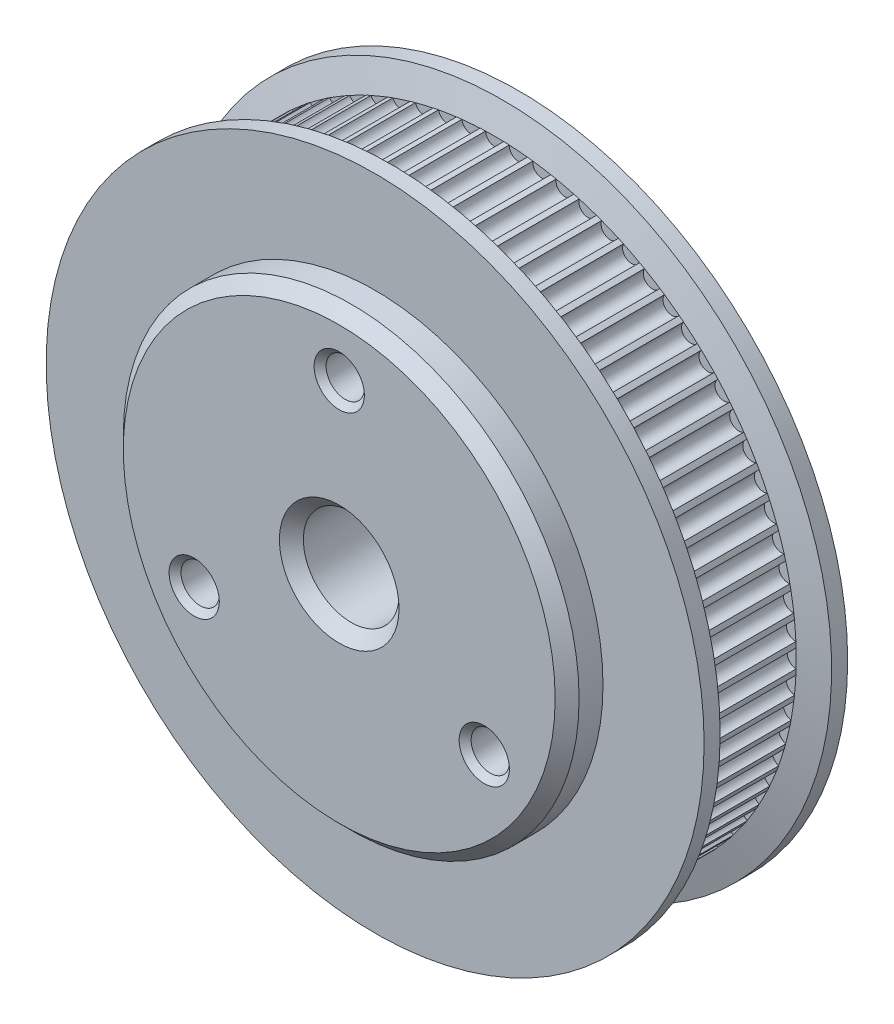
from build123d import *

# Parameters (mm, degrees)
BOSS_EXTRU_1_DEPTH           = 6
BOSS_EXTRU_1_DEPTH_BACK      = 6
ESQUISSE3_R                  = 27.5
BOSS_EXTRU_2_DEPTH           = 2
ESQUISSE7_R                  = 19.05
BOSS_EXTRU_3_DEPTH           = 3
ENL_V_MAT_EXTRU_1_DEPTH      = 40.918667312
ENL_V_MAT_EXTRU_1_DEPTH_BACK = 40.918667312
ESQUISSE6_R                  = 4
ESQUISSE6_R_2                = 1.6
CHANFREIN4_SIZE              = 1
CHANFREIN5_SIZE              = 0.5


with BuildPart() as part:
    # Esquisse1 → Boss.-Extru.1 (new, two sides: drawn at the far end of the back side and taken through both)
    with BuildSketch(Plane.XY.offset(-BOSS_EXTRU_1_DEPTH_BACK)):
        with BuildLine():
            ThreePointArc((0.759913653, -25.198044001), (0.989720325, -25.190064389), (1.219444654, -25.179988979))
            ThreePointArc((1.219444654, -25.179988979), (1.918285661, -24.374130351), (2.734586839, -25.060744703))
            ThreePointArc((2.734586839, -25.060744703), (2.963059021, -25.034759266), (3.191284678, -25.006690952))
            ThreePointArc((3.191284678, -25.006690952), (3.824744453, -24.148486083), (4.692400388, -24.76893758))
            ThreePointArc((4.692400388, -24.76893758), (4.918129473, -24.725106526), (5.143449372, -24.679218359))
            ThreePointArc((5.143449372, -24.679218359), (5.707622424, -23.773958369), (6.621283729, -24.32442172))
            ThreePointArc((6.621283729, -24.32442172), (6.842878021, -24.263015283), (7.06390299, -24.199590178))
            ThreePointArc((7.06390299, -24.199590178), (7.555311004, -23.252856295), (8.509344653, -23.729937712))
            ThreePointArc((8.509344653, -23.729937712), (8.72543795, -23.651334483), (8.940805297, -23.570763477))
            ThreePointArc((8.940805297, -23.570763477), (9.35641858, -22.58839263), (10.344942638, -22.989150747))
            ThreePointArc((10.344942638, -22.989150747), (10.554202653, -22.893835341), (10.762584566, -22.796615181))
            ThreePointArc((10.762584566, -22.796615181), (11.099840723, -21.784664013), (12.116760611, -22.106628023))
            ThreePointArc((12.116760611, -22.106628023), (12.317897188, -21.99518809), (12.518008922, -21.881918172))
            ThreePointArc((12.518008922, -21.881918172), (12.774828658, -20.846625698), (13.813874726, -21.087810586))
            ThreePointArc((13.813874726, -21.087810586), (14.005647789, -20.960933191), (14.196255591, -20.83231186))
            ThreePointArc((14.196255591, -20.83231186), (14.371055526, -19.780061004), (15.42582171, -19.938979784))
            ThreePointArc((15.42582171, -19.938979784), (15.607048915, -19.797447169), (15.786977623, -19.654267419))
            ThreePointArc((15.786977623, -19.654267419), (15.878680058, -18.591545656), (16.942663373, -18.667218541))
            ThreePointArc((16.942663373, -18.667218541), (17.112227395, -18.511903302), (17.280367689, -18.355047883))
            ThreePointArc((17.280367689, -18.355047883), (17.288407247, -17.288407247), (18.355047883, -17.280367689))
            ThreePointArc((18.355047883, -17.280367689), (18.511903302, -17.112227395), (18.667218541, -16.942663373))
            ThreePointArc((18.667218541, -16.942663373), (18.591545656, -15.878680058), (19.654267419, -15.786977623))
            ThreePointArc((19.654267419, -15.786977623), (19.797447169, -15.607048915), (19.938979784, -15.42582171))
            ThreePointArc((19.938979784, -15.42582171), (19.780061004, -14.371055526), (20.83231186, -14.196255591))
            ThreePointArc((20.83231186, -14.196255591), (20.960933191, -14.005647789), (21.087810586, -13.813874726))
            ThreePointArc((21.087810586, -13.813874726), (20.846625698, -12.774828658), (21.881918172, -12.518008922))
            ThreePointArc((21.881918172, -12.518008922), (21.99518809, -12.317897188), (22.106628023, -12.116760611))
            ThreePointArc((22.106628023, -12.116760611), (21.784664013, -11.099840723), (22.796615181, -10.762584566))
            ThreePointArc((22.796615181, -10.762584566), (22.893835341, -10.554202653), (22.989150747, -10.344942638))
            ThreePointArc((22.989150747, -10.344942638), (22.58839263, -9.35641858), (23.570763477, -8.940805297))
            ThreePointArc((23.570763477, -8.940805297), (23.651334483, -8.72543795), (23.729937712, -8.509344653))
            ThreePointArc((23.729937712, -8.509344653), (23.252856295, -7.555311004), (24.199590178, -7.06390299))
            ThreePointArc((24.199590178, -7.06390299), (24.263015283, -6.842878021), (24.32442172, -6.621283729))
            ThreePointArc((24.32442172, -6.621283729), (23.773958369, -5.707622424), (24.679218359, -5.143449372))
            ThreePointArc((24.679218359, -5.143449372), (24.725106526, -4.918129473), (24.76893758, -4.692400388))
            ThreePointArc((24.76893758, -4.692400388), (24.148486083, -3.824744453), (25.006690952, -3.191284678))
            ThreePointArc((25.006690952, -3.191284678), (25.034759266, -2.963059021), (25.060744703, -2.734586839))
            ThreePointArc((25.060744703, -2.734586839), (24.374130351, -1.918285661), (25.179988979, -1.219444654))
            ThreePointArc((25.179988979, -1.219444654), (25.190064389, -0.989720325), (25.198044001, -0.759913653))
            ThreePointArc((25.198044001, -0.759913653), (24.4495, 0), (25.198044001, 0.759913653))
            ThreePointArc((25.198044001, 0.759913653), (25.190064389, 0.989720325), (25.179988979, 1.219444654))
            ThreePointArc((25.179988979, 1.219444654), (24.374130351, 1.918285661), (25.060744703, 2.734586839))
            ThreePointArc((25.060744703, 2.734586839), (25.034759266, 2.963059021), (25.006690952, 3.191284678))
            ThreePointArc((25.006690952, 3.191284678), (24.148486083, 3.824744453), (24.76893758, 4.692400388))
            ThreePointArc((24.76893758, 4.692400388), (24.725106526, 4.918129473), (24.679218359, 5.143449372))
            ThreePointArc((24.679218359, 5.143449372), (23.773958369, 5.707622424), (24.32442172, 6.621283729))
            ThreePointArc((24.32442172, 6.621283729), (24.263015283, 6.842878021), (24.199590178, 7.06390299))
            ThreePointArc((24.199590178, 7.06390299), (23.252856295, 7.555311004), (23.729937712, 8.509344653))
            ThreePointArc((23.729937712, 8.509344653), (23.651334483, 8.72543795), (23.570763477, 8.940805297))
            ThreePointArc((23.570763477, 8.940805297), (22.58839263, 9.35641858), (22.989150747, 10.344942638))
            ThreePointArc((22.989150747, 10.344942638), (22.893835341, 10.554202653), (22.796615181, 10.762584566))
            ThreePointArc((22.796615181, 10.762584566), (21.784664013, 11.099840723), (22.106628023, 12.116760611))
            ThreePointArc((22.106628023, 12.116760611), (21.99518809, 12.317897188), (21.881918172, 12.518008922))
            ThreePointArc((21.881918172, 12.518008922), (20.846625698, 12.774828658), (21.087810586, 13.813874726))
            ThreePointArc((21.087810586, 13.813874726), (20.960933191, 14.005647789), (20.83231186, 14.196255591))
            ThreePointArc((20.83231186, 14.196255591), (19.780061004, 14.371055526), (19.938979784, 15.42582171))
            ThreePointArc((19.938979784, 15.42582171), (19.797447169, 15.607048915), (19.654267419, 15.786977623))
            ThreePointArc((19.654267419, 15.786977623), (18.591545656, 15.878680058), (18.667218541, 16.942663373))
            ThreePointArc((18.667218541, 16.942663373), (18.511903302, 17.112227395), (18.355047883, 17.280367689))
            ThreePointArc((18.355047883, 17.280367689), (17.288407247, 17.288407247), (17.280367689, 18.355047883))
            ThreePointArc((17.280367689, 18.355047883), (17.112227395, 18.511903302), (16.942663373, 18.667218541))
            ThreePointArc((16.942663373, 18.667218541), (15.878680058, 18.591545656), (15.786977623, 19.654267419))
            ThreePointArc((15.786977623, 19.654267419), (15.607048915, 19.797447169), (15.42582171, 19.938979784))
            ThreePointArc((15.42582171, 19.938979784), (14.371055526, 19.780061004), (14.196255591, 20.83231186))
            ThreePointArc((14.196255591, 20.83231186), (14.005647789, 20.960933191), (13.813874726, 21.087810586))
            ThreePointArc((13.813874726, 21.087810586), (12.774828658, 20.846625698), (12.518008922, 21.881918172))
            ThreePointArc((12.518008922, 21.881918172), (12.317897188, 21.99518809), (12.116760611, 22.106628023))
            ThreePointArc((12.116760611, 22.106628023), (11.099840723, 21.784664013), (10.762584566, 22.796615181))
            ThreePointArc((10.762584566, 22.796615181), (10.554202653, 22.893835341), (10.344942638, 22.989150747))
            ThreePointArc((10.344942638, 22.989150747), (9.35641858, 22.58839263), (8.940805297, 23.570763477))
            ThreePointArc((8.940805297, 23.570763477), (8.72543795, 23.651334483), (8.509344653, 23.729937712))
            ThreePointArc((8.509344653, 23.729937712), (7.555311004, 23.252856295), (7.06390299, 24.199590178))
            ThreePointArc((7.06390299, 24.199590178), (6.842878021, 24.263015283), (6.621283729, 24.32442172))
            ThreePointArc((6.621283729, 24.32442172), (5.707622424, 23.773958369), (5.143449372, 24.679218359))
            ThreePointArc((5.143449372, 24.679218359), (4.918129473, 24.725106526), (4.692400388, 24.76893758))
            ThreePointArc((4.692400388, 24.76893758), (3.824744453, 24.148486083), (3.191284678, 25.006690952))
            ThreePointArc((3.191284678, 25.006690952), (2.963059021, 25.034759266), (2.734586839, 25.060744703))
            ThreePointArc((2.734586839, 25.060744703), (1.918285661, 24.374130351), (1.219444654, 25.179988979))
            ThreePointArc((1.219444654, 25.179988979), (0.989720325, 25.190064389), (0.759913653, 25.198044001))
            ThreePointArc((0.759913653, 25.198044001), (0, 24.4495), (-0.759913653, 25.198044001))
            ThreePointArc((-0.759913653, 25.198044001), (-0.989720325, 25.190064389), (-1.219444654, 25.179988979))
            ThreePointArc((-1.219444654, 25.179988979), (-1.918285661, 24.374130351), (-2.734586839, 25.060744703))
            ThreePointArc((-2.734586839, 25.060744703), (-2.963059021, 25.034759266), (-3.191284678, 25.006690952))
            ThreePointArc((-3.191284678, 25.006690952), (-3.824744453, 24.148486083), (-4.692400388, 24.76893758))
            ThreePointArc((-4.692400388, 24.76893758), (-4.918129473, 24.725106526), (-5.143449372, 24.679218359))
            ThreePointArc((-5.143449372, 24.679218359), (-5.707622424, 23.773958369), (-6.621283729, 24.32442172))
            ThreePointArc((-6.621283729, 24.32442172), (-6.842878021, 24.263015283), (-7.06390299, 24.199590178))
            ThreePointArc((-7.06390299, 24.199590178), (-7.555311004, 23.252856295), (-8.509344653, 23.729937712))
            ThreePointArc((-8.509344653, 23.729937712), (-8.72543795, 23.651334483), (-8.940805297, 23.570763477))
            ThreePointArc((-8.940805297, 23.570763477), (-9.35641858, 22.58839263), (-10.344942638, 22.989150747))
            ThreePointArc((-10.344942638, 22.989150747), (-10.554202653, 22.893835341), (-10.762584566, 22.796615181))
            ThreePointArc((-10.762584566, 22.796615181), (-11.099840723, 21.784664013), (-12.116760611, 22.106628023))
            ThreePointArc((-12.116760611, 22.106628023), (-12.317897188, 21.99518809), (-12.518008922, 21.881918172))
            ThreePointArc((-12.518008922, 21.881918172), (-12.774828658, 20.846625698), (-13.813874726, 21.087810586))
            ThreePointArc((-13.813874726, 21.087810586), (-14.005647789, 20.960933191), (-14.196255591, 20.83231186))
            ThreePointArc((-14.196255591, 20.83231186), (-14.371055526, 19.780061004), (-15.42582171, 19.938979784))
            ThreePointArc((-15.42582171, 19.938979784), (-15.607048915, 19.797447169), (-15.786977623, 19.654267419))
            ThreePointArc((-15.786977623, 19.654267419), (-15.878680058, 18.591545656), (-16.942663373, 18.667218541))
            ThreePointArc((-16.942663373, 18.667218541), (-17.112227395, 18.511903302), (-17.280367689, 18.355047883))
            ThreePointArc((-17.280367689, 18.355047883), (-17.288407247, 17.288407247), (-18.355047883, 17.280367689))
            ThreePointArc((-18.355047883, 17.280367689), (-18.511903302, 17.112227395), (-18.667218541, 16.942663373))
            ThreePointArc((-18.667218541, 16.942663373), (-18.591545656, 15.878680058), (-19.654267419, 15.786977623))
            ThreePointArc((-19.654267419, 15.786977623), (-19.797447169, 15.607048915), (-19.938979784, 15.42582171))
            ThreePointArc((-19.938979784, 15.42582171), (-19.780061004, 14.371055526), (-20.83231186, 14.196255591))
            ThreePointArc((-20.83231186, 14.196255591), (-20.960933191, 14.005647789), (-21.087810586, 13.813874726))
            ThreePointArc((-21.087810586, 13.813874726), (-20.846625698, 12.774828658), (-21.881918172, 12.518008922))
            ThreePointArc((-21.881918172, 12.518008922), (-21.99518809, 12.317897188), (-22.106628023, 12.116760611))
            ThreePointArc((-22.106628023, 12.116760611), (-21.784664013, 11.099840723), (-22.796615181, 10.762584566))
            ThreePointArc((-22.796615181, 10.762584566), (-22.893835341, 10.554202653), (-22.989150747, 10.344942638))
            ThreePointArc((-22.989150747, 10.344942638), (-22.58839263, 9.35641858), (-23.570763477, 8.940805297))
            ThreePointArc((-23.570763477, 8.940805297), (-23.651334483, 8.72543795), (-23.729937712, 8.509344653))
            ThreePointArc((-23.729937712, 8.509344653), (-23.252856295, 7.555311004), (-24.199590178, 7.06390299))
            ThreePointArc((-24.199590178, 7.06390299), (-24.263015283, 6.842878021), (-24.32442172, 6.621283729))
            ThreePointArc((-24.32442172, 6.621283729), (-23.773958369, 5.707622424), (-24.679218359, 5.143449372))
            ThreePointArc((-24.679218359, 5.143449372), (-24.725106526, 4.918129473), (-24.76893758, 4.692400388))
            ThreePointArc((-24.76893758, 4.692400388), (-24.148486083, 3.824744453), (-25.006690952, 3.191284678))
            ThreePointArc((-25.006690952, 3.191284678), (-25.034759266, 2.963059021), (-25.060744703, 2.734586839))
            ThreePointArc((-25.060744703, 2.734586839), (-24.374130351, 1.918285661), (-25.179988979, 1.219444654))
            ThreePointArc((-25.179988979, 1.219444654), (-25.190064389, 0.989720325), (-25.198044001, 0.759913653))
            ThreePointArc((-25.198044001, 0.759913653), (-24.4495, 0), (-25.198044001, -0.759913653))
            ThreePointArc((-25.198044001, -0.759913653), (-25.190064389, -0.989720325), (-25.179988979, -1.219444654))
            ThreePointArc((-25.179988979, -1.219444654), (-24.374130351, -1.918285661), (-25.060744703, -2.734586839))
            ThreePointArc((-25.060744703, -2.734586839), (-25.034759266, -2.963059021), (-25.006690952, -3.191284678))
            ThreePointArc((-25.006690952, -3.191284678), (-24.148486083, -3.824744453), (-24.76893758, -4.692400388))
            ThreePointArc((-24.76893758, -4.692400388), (-24.725106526, -4.918129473), (-24.679218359, -5.143449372))
            ThreePointArc((-24.679218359, -5.143449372), (-23.773958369, -5.707622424), (-24.32442172, -6.621283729))
            ThreePointArc((-24.32442172, -6.621283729), (-24.263015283, -6.842878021), (-24.199590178, -7.06390299))
            ThreePointArc((-24.199590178, -7.06390299), (-23.252856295, -7.555311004), (-23.729937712, -8.509344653))
            ThreePointArc((-23.729937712, -8.509344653), (-23.651334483, -8.72543795), (-23.570763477, -8.940805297))
            ThreePointArc((-23.570763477, -8.940805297), (-22.58839263, -9.35641858), (-22.989150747, -10.344942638))
            ThreePointArc((-22.989150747, -10.344942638), (-22.893835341, -10.554202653), (-22.796615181, -10.762584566))
            ThreePointArc((-22.796615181, -10.762584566), (-21.784664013, -11.099840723), (-22.106628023, -12.116760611))
            ThreePointArc((-22.106628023, -12.116760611), (-21.99518809, -12.317897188), (-21.881918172, -12.518008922))
            ThreePointArc((-21.881918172, -12.518008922), (-20.846625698, -12.774828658), (-21.087810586, -13.813874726))
            ThreePointArc((-21.087810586, -13.813874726), (-20.960933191, -14.005647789), (-20.83231186, -14.196255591))
            ThreePointArc((-20.83231186, -14.196255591), (-19.780061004, -14.371055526), (-19.938979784, -15.42582171))
            ThreePointArc((-19.938979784, -15.42582171), (-19.797447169, -15.607048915), (-19.654267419, -15.786977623))
            ThreePointArc((-19.654267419, -15.786977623), (-18.591545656, -15.878680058), (-18.667218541, -16.942663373))
            ThreePointArc((-18.667218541, -16.942663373), (-18.511903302, -17.112227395), (-18.355047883, -17.280367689))
            ThreePointArc((-18.355047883, -17.280367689), (-17.288407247, -17.288407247), (-17.280367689, -18.355047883))
            ThreePointArc((-17.280367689, -18.355047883), (-17.112227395, -18.511903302), (-16.942663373, -18.667218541))
            ThreePointArc((-16.942663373, -18.667218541), (-15.878680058, -18.591545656), (-15.786977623, -19.654267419))
            ThreePointArc((-15.786977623, -19.654267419), (-15.607048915, -19.797447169), (-15.42582171, -19.938979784))
            ThreePointArc((-15.42582171, -19.938979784), (-14.371055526, -19.780061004), (-14.196255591, -20.83231186))
            ThreePointArc((-14.196255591, -20.83231186), (-14.005647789, -20.960933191), (-13.813874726, -21.087810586))
            ThreePointArc((-13.813874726, -21.087810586), (-12.774828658, -20.846625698), (-12.518008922, -21.881918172))
            ThreePointArc((-12.518008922, -21.881918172), (-12.317897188, -21.99518809), (-12.116760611, -22.106628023))
            ThreePointArc((-12.116760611, -22.106628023), (-11.099840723, -21.784664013), (-10.762584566, -22.796615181))
            ThreePointArc((-10.762584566, -22.796615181), (-10.554202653, -22.893835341), (-10.344942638, -22.989150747))
            ThreePointArc((-10.344942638, -22.989150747), (-9.35641858, -22.58839263), (-8.940805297, -23.570763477))
            ThreePointArc((-8.940805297, -23.570763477), (-8.72543795, -23.651334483), (-8.509344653, -23.729937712))
            ThreePointArc((-8.509344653, -23.729937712), (-7.555311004, -23.252856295), (-7.06390299, -24.199590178))
            ThreePointArc((-7.06390299, -24.199590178), (-6.842878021, -24.263015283), (-6.621283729, -24.32442172))
            ThreePointArc((-6.621283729, -24.32442172), (-5.707622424, -23.773958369), (-5.143449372, -24.679218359))
            ThreePointArc((-5.143449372, -24.679218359), (-4.918129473, -24.725106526), (-4.692400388, -24.76893758))
            ThreePointArc((-4.692400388, -24.76893758), (-3.824744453, -24.148486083), (-3.191284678, -25.006690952))
            ThreePointArc((-3.191284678, -25.006690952), (-2.963059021, -25.034759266), (-2.734586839, -25.060744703))
            ThreePointArc((-2.734586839, -25.060744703), (-1.918285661, -24.374130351), (-1.219444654, -25.179988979))
            ThreePointArc((-1.219444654, -25.179988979), (-0.989720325, -25.190064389), (-0.759913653, -25.198044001))
            ThreePointArc((-0.759913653, -25.198044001), (0, -24.4495), (0.759913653, -25.198044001))
        make_face()
    extrude(amount=BOSS_EXTRU_1_DEPTH + BOSS_EXTRU_1_DEPTH_BACK)

    # Esquisse3 → Boss.-Extru.2 (add)
    with BuildSketch(Plane.XY.offset(6)):
        Circle(ESQUISSE3_R)
    boss_extru_2 = extrude(amount=-BOSS_EXTRU_2_DEPTH)

    # Esquisse4 → Enl_vement de mati_re-R_volution1 (revolve, cut)
    with BuildSketch(Plane(origin=(0, 0, 0), x_dir=(0, 0, -1), z_dir=(1, 0, 0)), mode=Mode.PRIVATE) as enl_vement_de_mati_re_r_volution1_sk:
        Polygon((-4, 25.198044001), (-5.35108909, 29.909851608), (-1.448526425, 29.909851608), align=None)
    enl_vement_de_mati_re_r_volution1 = revolve(enl_vement_de_mati_re_r_volution1_sk.sketch.rotate(Axis((0, 0, 9.447235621), (0, 0, -1)), 90), axis=Axis((0, 0, 9.447235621), (0, 0, -1)), mode=Mode.SUBTRACT)

    # Sym_trie1: Boss.-Extru.2, Enl_vement de mati_re-R_volution1 across plane
    add(boss_extru_2.mirror(Plane.XY))
    add(enl_vement_de_mati_re_r_volution1.mirror(Plane.XY), mode=Mode.SUBTRACT)

    # Esquisse7 → Boss.-Extru.3 (add)
    with BuildSketch(Plane.XY.offset(6)):
        Circle(ESQUISSE7_R)
    extrude(amount=BOSS_EXTRU_3_DEPTH)

    # Esquisse6 → Enl_v. mat.-Extru.1 (cut, two sides: drawn at the far end of the back side and taken through both)
    with BuildSketch(Plane.XY.offset(-ENL_V_MAT_EXTRU_1_DEPTH_BACK)):
        Circle(ESQUISSE6_R)
        with Locations((0, 14)):
            Circle(ESQUISSE6_R_2)
        with Locations((12.124355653, -7)):
            Circle(ESQUISSE6_R_2)
        with Locations((-12.124355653, -7)):
            Circle(ESQUISSE6_R_2)
    extrude(amount=ENL_V_MAT_EXTRU_1_DEPTH + ENL_V_MAT_EXTRU_1_DEPTH_BACK, mode=Mode.SUBTRACT)

    # Chanfrein4
    chanfrein4_edges = [part.edges().sort_by_distance(p)[0] for p in [
        (-19.05, 0, 9),
        (-4, 0, -6),
        (-4, 0, 9),
    ]]
    chamfer(chanfrein4_edges, length=CHANFREIN4_SIZE)

    # Chanfrein5
    chanfrein5_edges = [part.edges().sort_by_distance(p)[0] for p in [
        (-1.6, 14, -6),
        (-1.6, 14, 9),
        (10.524355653, -7, -6),
        (10.524355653, -7, 9),
        (-13.724355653, -7, -6),
        (-13.724355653, -7, 9),
    ]]
    chamfer(chanfrein5_edges, length=CHANFREIN5_SIZE)


solid = part.part
